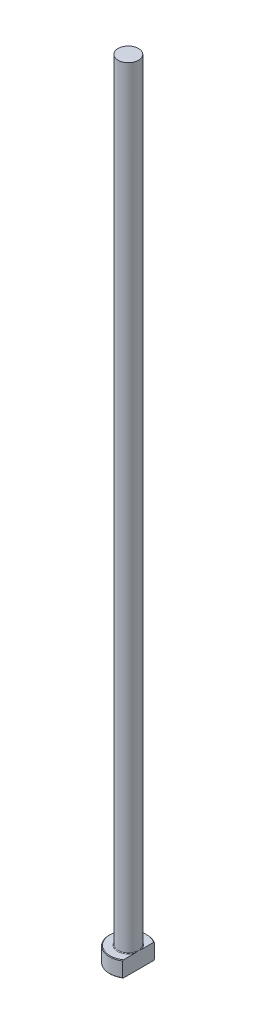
ISO-10303-21;
HEADER;
FILE_DESCRIPTION(('STEP AP214'),'2;1');
FILE_NAME('part.step','',(''),(''),'','','');
FILE_SCHEMA(('AUTOMOTIVE_DESIGN { 1 0 10303 214 1 1 1 1 }'));
ENDSEC;
DATA;
#1=APPLICATION_CONTEXT('core data for automotive mechanical design processes');
#2=APPLICATION_PROTOCOL_DEFINITION('international standard','automotive_design',2000,#1);
#3=PRODUCT_CONTEXT('',#1,'mechanical');
#4=PRODUCT('Part','Part','',(#3));
#5=PRODUCT_RELATED_PRODUCT_CATEGORY('part','',(#4));
#6=PRODUCT_DEFINITION_FORMATION('','',#4);
#7=PRODUCT_DEFINITION_CONTEXT('part definition',#1,'design');
#8=PRODUCT_DEFINITION('design','',#6,#7);
#9=PRODUCT_DEFINITION_SHAPE('','',#8);
#10=(LENGTH_UNIT() NAMED_UNIT(*) SI_UNIT(.MILLI.,.METRE.));
#11=(NAMED_UNIT(*) PLANE_ANGLE_UNIT() SI_UNIT($,.RADIAN.));
#12=(NAMED_UNIT(*) SI_UNIT($,.STERADIAN.) SOLID_ANGLE_UNIT());
#13=UNCERTAINTY_MEASURE_WITH_UNIT(LENGTH_MEASURE(1.E-05),#10,'distance_accuracy_value','');
#14=(GEOMETRIC_REPRESENTATION_CONTEXT(3) GLOBAL_UNCERTAINTY_ASSIGNED_CONTEXT((#13)) GLOBAL_UNIT_ASSIGNED_CONTEXT((#10,
#11,#12)) REPRESENTATION_CONTEXT('',''));
#15=CARTESIAN_POINT('',(0.,0.,0.));
#16=DIRECTION('',(0.,0.,1.));
#17=DIRECTION('',(1.,0.,0.));
#18=AXIS2_PLACEMENT_3D('',#15,#16,#17);
#19=CARTESIAN_POINT('',(0.,0.,0.));
#20=DIRECTION('',(0.,-1.,0.));
#21=DIRECTION('',(0.,0.,-1.));
#22=AXIS2_PLACEMENT_3D('',#19,#20,#21);
#23=PLANE('',#22);
#24=CARTESIAN_POINT('',(0.,0.,0.));
#25=DIRECTION('',(0.,-1.,0.));
#26=DIRECTION('',(0.,0.,-1.));
#27=AXIS2_PLACEMENT_3D('',#24,#25,#26);
#28=CIRCLE('',#27,5.79999999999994);
#29=CARTESIAN_POINT('',(3.24999999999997,0.,4.80390466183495));
#30=VERTEX_POINT('',#29);
#31=CARTESIAN_POINT('',(3.24999999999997,0.,-4.80390466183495));
#32=VERTEX_POINT('',#31);
#33=EDGE_CURVE('E98',#30,#32,#28,.T.);
#34=ORIENTED_EDGE('',*,*,#33,.T.);
#35=DIRECTION('',(0.,0.,1.));
#36=VECTOR('',#35,1.);
#37=CARTESIAN_POINT('',(3.24999999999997,0.,-5.04356025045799));
#38=LINE('',#37,#36);
#39=EDGE_CURVE('E83',#32,#30,#38,.T.);
#40=ORIENTED_EDGE('',*,*,#39,.T.);
#41=EDGE_LOOP('',(#34,#40));
#42=FACE_BOUND('',#41,.T.);
#43=ADVANCED_FACE('F32',(#42),#23,.T.);
#44=CARTESIAN_POINT('',(0.,259.958771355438,0.));
#45=DIRECTION('',(0.,1.,0.));
#46=DIRECTION('',(0.,0.,1.));
#47=AXIS2_PLACEMENT_3D('',#44,#45,#46);
#48=CYLINDRICAL_SURFACE('',#47,5.99999999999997);
#49=CARTESIAN_POINT('',(0.,4.80000000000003,0.));
#50=DIRECTION('',(0.,1.,0.));
#51=DIRECTION('',(0.,0.,1.));
#52=AXIS2_PLACEMENT_3D('',#49,#50,#51);
#53=CIRCLE('',#52,5.99999999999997);
#54=CARTESIAN_POINT('',(3.24999999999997,4.80000000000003,5.04356025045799));
#55=VERTEX_POINT('',#54);
#56=CARTESIAN_POINT('',(3.24999999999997,4.80000000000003,-5.04356025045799));
#57=VERTEX_POINT('',#56);
#58=EDGE_CURVE('E104',#55,#57,#53,.F.);
#59=ORIENTED_EDGE('',*,*,#58,.T.);
#60=DIRECTION('',(0.,-1.,0.));
#61=VECTOR('',#60,1.);
#62=CARTESIAN_POINT('',(3.24999999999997,250.,-5.04356025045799));
#63=LINE('',#62,#61);
#64=CARTESIAN_POINT('',(3.24999999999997,0.200000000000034,-5.04356025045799));
#65=VERTEX_POINT('',#64);
#66=EDGE_CURVE('E183',#57,#65,#63,.T.);
#67=ORIENTED_EDGE('',*,*,#66,.T.);
#68=CARTESIAN_POINT('',(0.,0.200000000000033,0.));
#69=DIRECTION('',(0.,-1.,0.));
#70=DIRECTION('',(0.,0.,-1.));
#71=AXIS2_PLACEMENT_3D('',#68,#69,#70);
#72=CIRCLE('',#71,5.99999999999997);
#73=CARTESIAN_POINT('',(3.24999999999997,0.200000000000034,5.04356025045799));
#74=VERTEX_POINT('',#73);
#75=EDGE_CURVE('E100',#65,#74,#72,.F.);
#76=ORIENTED_EDGE('',*,*,#75,.T.);
#77=DIRECTION('',(0.,-1.,0.));
#78=VECTOR('',#77,1.);
#79=CARTESIAN_POINT('',(3.24999999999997,250.,5.04356025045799));
#80=LINE('',#79,#78);
#81=EDGE_CURVE('E93',#55,#74,#80,.T.);
#82=ORIENTED_EDGE('',*,*,#81,.F.);
#83=EDGE_LOOP('',(#59,#67,#76,#82));
#84=FACE_BOUND('',#83,.T.);
#85=ADVANCED_FACE('F158',(#84),#48,.T.);
#86=CARTESIAN_POINT('',(-5.99999999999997,5.,0.));
#87=DIRECTION('',(0.,1.,0.));
#88=DIRECTION('',(0.,0.,1.));
#89=AXIS2_PLACEMENT_3D('',#86,#87,#88);
#90=PLANE('',#89);
#91=CARTESIAN_POINT('',(0.,5.,0.));
#92=DIRECTION('',(0.,1.,0.));
#93=DIRECTION('',(0.,0.,1.));
#94=AXIS2_PLACEMENT_3D('',#91,#92,#93);
#95=CIRCLE('',#94,5.79999999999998);
#96=CARTESIAN_POINT('',(3.24999999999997,5.,-4.80390466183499));
#97=VERTEX_POINT('',#96);
#98=CARTESIAN_POINT('',(3.24999999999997,5.,4.80390466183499));
#99=VERTEX_POINT('',#98);
#100=EDGE_CURVE('E178',#97,#99,#95,.T.);
#101=ORIENTED_EDGE('',*,*,#100,.T.);
#102=DIRECTION('',(0.,0.,-1.));
#103=VECTOR('',#102,1.);
#104=CARTESIAN_POINT('',(3.24999999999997,5.,0.));
#105=LINE('',#104,#103);
#106=CARTESIAN_POINT('',(3.24999999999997,4.99999999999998,1.15758369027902));
#107=VERTEX_POINT('',#106);
#108=EDGE_CURVE('E57',#99,#107,#105,.T.);
#109=ORIENTED_EDGE('',*,*,#108,.T.);
#110=CARTESIAN_POINT('',(0.,5.,0.));
#111=DIRECTION('',(0.,1.,0.));
#112=DIRECTION('',(0.,0.,1.));
#113=AXIS2_PLACEMENT_3D('',#110,#111,#112);
#114=CIRCLE('',#113,3.44999999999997);
#115=CARTESIAN_POINT('',(3.24999999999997,4.99999999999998,-1.15758369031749));
#116=VERTEX_POINT('',#115);
#117=EDGE_CURVE('E107',#107,#116,#114,.F.);
#118=ORIENTED_EDGE('',*,*,#117,.T.);
#119=EDGE_CURVE('E136',#116,#97,#105,.T.);
#120=ORIENTED_EDGE('',*,*,#119,.T.);
#121=EDGE_LOOP('',(#101,#109,#118,#120));
#122=FACE_BOUND('',#121,.T.);
#123=ADVANCED_FACE('F147',(#122),#90,.T.);
#124=CARTESIAN_POINT('',(0.,5.,0.));
#125=DIRECTION('',(0.,-1.,0.));
#126=DIRECTION('',(0.,0.,-1.));
#127=AXIS2_PLACEMENT_3D('',#124,#125,#126);
#128=CONICAL_SURFACE('',#127,5.79999999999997,0.785398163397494);
#129=ORIENTED_EDGE('',*,*,#58,.F.);
#130=CARTESIAN_POINT('',(3.24999999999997,-0.763340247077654,11.097222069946));
#131=CARTESIAN_POINT('',(3.24999999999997,-0.555249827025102,10.8803821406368));
#132=CARTESIAN_POINT('',(3.24999999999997,-0.347401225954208,10.6633095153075));
#133=CARTESIAN_POINT('',(3.24999999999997,0.0676973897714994,10.2285893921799));
#134=CARTESIAN_POINT('',(3.24999999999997,0.274947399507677,10.010941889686));
#135=CARTESIAN_POINT('',(3.24999999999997,0.68879015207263,9.5749031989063));
#136=CARTESIAN_POINT('',(3.24999999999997,0.895382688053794,9.35651181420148));
#137=CARTESIAN_POINT('',(3.24999999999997,1.30769007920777,8.91890298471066));
#138=CARTESIAN_POINT('',(3.24999999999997,1.51340493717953,8.69968554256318));
#139=CARTESIAN_POINT('',(3.24999999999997,1.92056067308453,8.26365159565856));
#140=CARTESIAN_POINT('',(3.24999999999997,2.1220182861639,8.04685072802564));
#141=CARTESIAN_POINT('',(3.24999999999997,2.52361432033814,7.61203089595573));
#142=CARTESIAN_POINT('',(3.24999999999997,2.72375274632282,7.39401193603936));
#143=CARTESIAN_POINT('',(3.24999999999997,3.1223203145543,6.95646589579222));
#144=CARTESIAN_POINT('',(3.24999999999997,3.32074966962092,6.73693900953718));
#145=CARTESIAN_POINT('',(3.24999999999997,3.71541049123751,6.2959206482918));
#146=CARTESIAN_POINT('',(3.24999999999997,3.91164199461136,6.07442920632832));
#147=CARTESIAN_POINT('',(3.24999999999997,4.26795525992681,5.66684646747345));
#148=CARTESIAN_POINT('',(3.24999999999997,4.42849662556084,5.48115751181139));
#149=CARTESIAN_POINT('',(3.24999999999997,4.74694681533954,5.10749706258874));
#150=CARTESIAN_POINT('',(3.24999999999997,4.9048553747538,4.91952534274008));
#151=CARTESIAN_POINT('',(3.24999999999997,5.21865243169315,4.53879767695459));
#152=CARTESIAN_POINT('',(3.24999999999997,5.37450606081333,4.34601291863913));
#153=CARTESIAN_POINT('',(3.24999999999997,5.68118935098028,3.95653844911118));
#154=CARTESIAN_POINT('',(3.24999999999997,5.83202036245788,3.75984981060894));
#155=CARTESIAN_POINT('',(3.24999999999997,6.05390638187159,3.4594085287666));
#156=CARTESIAN_POINT('',(3.24999999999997,6.12763821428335,3.35763377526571));
#157=CARTESIAN_POINT('',(3.24999999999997,6.27282302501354,3.15247478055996));
#158=CARTESIAN_POINT('',(3.24999999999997,6.3442761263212,3.04909062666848));
#159=CARTESIAN_POINT('',(3.24999999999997,6.48448981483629,2.84026816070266));
#160=CARTESIAN_POINT('',(3.24999999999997,6.55324599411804,2.7348268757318));
#161=CARTESIAN_POINT('',(3.24999999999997,6.68723865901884,2.52174014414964));
#162=CARTESIAN_POINT('',(3.24999999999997,6.75247550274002,2.4140949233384));
#163=CARTESIAN_POINT('',(3.24999999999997,6.87780644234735,2.19745654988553));
#164=CARTESIAN_POINT('',(3.24999999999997,6.93795082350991,2.08849289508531));
#165=CARTESIAN_POINT('',(3.24999999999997,7.05273719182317,1.86772106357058));
#166=CARTESIAN_POINT('',(3.24999999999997,7.10737807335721,1.75591232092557));
#167=CARTESIAN_POINT('',(3.24999999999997,7.26056715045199,1.41626442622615));
#168=CARTESIAN_POINT('',(3.24999999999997,7.34888232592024,1.1833811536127));
#169=CARTESIAN_POINT('',(3.24999999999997,7.44593218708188,0.835575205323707));
#170=CARTESIAN_POINT('',(3.24999999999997,7.4718222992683,0.725406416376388));
#171=CARTESIAN_POINT('',(3.24999999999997,7.51310579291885,0.5030789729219));
#172=CARTESIAN_POINT('',(3.24999999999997,7.52850034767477,0.390920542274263));
#173=CARTESIAN_POINT('',(3.24999999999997,7.54767882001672,0.166070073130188));
#174=CARTESIAN_POINT('',(3.24999999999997,7.5515109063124,0.0533822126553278));
#175=CARTESIAN_POINT('',(3.24999999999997,7.54741082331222,-0.171782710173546));
#176=CARTESIAN_POINT('',(3.24999999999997,7.5394779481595,-0.28425975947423));
#177=CARTESIAN_POINT('',(3.24999999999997,7.51253523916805,-0.507025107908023));
#178=CARTESIAN_POINT('',(3.24999999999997,7.4936058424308,-0.617323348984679));
#179=CARTESIAN_POINT('',(3.24999999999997,7.44595440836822,-0.835762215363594));
#180=CARTESIAN_POINT('',(3.24999999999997,7.41723093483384,-0.943902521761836));
#181=CARTESIAN_POINT('',(3.24999999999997,7.35127840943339,-1.15830231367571));
#182=CARTESIAN_POINT('',(3.24999999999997,7.31399439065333,-1.26454464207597));
#183=CARTESIAN_POINT('',(3.24999999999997,7.23254630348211,-1.47430332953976));
#184=CARTESIAN_POINT('',(3.24999999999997,7.18838353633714,-1.57782019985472));
#185=CARTESIAN_POINT('',(3.24999999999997,7.09672451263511,-1.7774238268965));
#186=CARTESIAN_POINT('',(3.24999999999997,7.04948595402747,-1.87363004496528));
#187=CARTESIAN_POINT('',(3.24999999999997,6.95089019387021,-2.06391775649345));
#188=CARTESIAN_POINT('',(3.24999999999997,6.89953216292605,-2.15799881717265));
#189=CARTESIAN_POINT('',(3.24999999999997,6.74036914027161,-2.43755985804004));
#190=CARTESIAN_POINT('',(3.24999999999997,6.62755752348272,-2.62018561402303));
#191=CARTESIAN_POINT('',(3.24999999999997,6.39256809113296,-2.98019331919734));
#192=CARTESIAN_POINT('',(3.24999999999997,6.27035601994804,-3.15755247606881));
#193=CARTESIAN_POINT('',(3.24999999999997,6.0197011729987,-3.50765833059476));
#194=CARTESIAN_POINT('',(3.24999999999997,5.8912614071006,-3.68040719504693));
#195=CARTESIAN_POINT('',(3.24999999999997,5.62829316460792,-4.02448614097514));
#196=CARTESIAN_POINT('',(3.24999999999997,5.49371006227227,-4.19577421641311));
#197=CARTESIAN_POINT('',(3.24999999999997,5.22110967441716,-4.5356145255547));
#198=CARTESIAN_POINT('',(3.24999999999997,5.08309204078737,-4.70416647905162));
#199=CARTESIAN_POINT('',(3.24999999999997,4.80478673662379,-5.03871726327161));
#200=CARTESIAN_POINT('',(3.24999999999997,4.66450509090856,-5.20472111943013));
#201=CARTESIAN_POINT('',(3.24999999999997,4.38193422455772,-5.53501285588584));
#202=CARTESIAN_POINT('',(3.24999999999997,4.23964496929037,-5.69930070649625));
#203=CARTESIAN_POINT('',(3.24999999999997,3.89726045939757,-6.09077577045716));
#204=CARTESIAN_POINT('',(3.24999999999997,3.69642117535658,-6.31731165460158));
#205=CARTESIAN_POINT('',(3.24999999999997,3.29246897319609,-6.76834962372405));
#206=CARTESIAN_POINT('',(3.24999999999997,3.08935601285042,-6.99285167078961));
#207=CARTESIAN_POINT('',(3.24999999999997,2.68122553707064,-7.44046009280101));
#208=CARTESIAN_POINT('',(3.24999999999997,2.47620657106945,-7.66356514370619));
#209=CARTESIAN_POINT('',(3.24999999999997,2.06481442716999,-8.10852300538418));
#210=CARTESIAN_POINT('',(3.24999999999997,1.85844124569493,-8.33037581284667));
#211=CARTESIAN_POINT('',(3.24999999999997,1.45176082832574,-8.76543407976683));
#212=CARTESIAN_POINT('',(3.24999999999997,1.25149010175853,-8.9786736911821));
#213=CARTESIAN_POINT('',(3.24999999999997,0.850131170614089,-9.40438299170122));
#214=CARTESIAN_POINT('',(3.24999999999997,0.649042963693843,-9.61685267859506));
#215=CARTESIAN_POINT('',(3.24999999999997,0.246391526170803,-10.0409455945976));
#216=CARTESIAN_POINT('',(3.24999999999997,0.0448289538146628,-10.2525694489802));
#217=CARTESIAN_POINT('',(3.24999999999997,-0.358859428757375,-10.6752763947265));
#218=CARTESIAN_POINT('',(3.24999999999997,-0.560985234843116,-10.8863594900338));
#219=CARTESIAN_POINT('',(3.24999999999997,-0.763340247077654,-11.097222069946));
#220=B_SPLINE_CURVE_WITH_KNOTS('',3,(#130,#131,#132,#133,#134,#135,#136,#137,#138,#139,#140,
#141,#142,#143,#144,#145,#146,#147,#148,#149,#150,#151,#152,#153,#154,#155,#156,#157,#158,#159,
#160,#161,#162,#163,#164,#165,#166,#167,#168,#169,#170,#171,#172,#173,#174,#175,#176,#177,#178,
#179,#180,#181,#182,#183,#184,#185,#186,#187,#188,#189,#190,#191,#192,#193,#194,#195,#196,#197,
#198,#199,#200,#201,#202,#203,#204,#205,#206,#207,#208,#209,#210,#211,#212,#213,#214,#215,#216,
#217,#218,#219),.UNSPECIFIED.,.F.,.F.,(4,2,2,2,2,2,2,2,2,2,2,2,2,2,2,2,2,2,2,2,2,2,2,2,2,2,2,2,
2,2,2,2,2,2,2,2,2,2,2,2,2,2,2,2,4),(0.,0.901604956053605,1.80321729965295,2.70508973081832,
3.60695928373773,4.49481204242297,5.3826615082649,6.27039876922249,7.15812113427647,
7.89450333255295,8.63095913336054,9.37461869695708,10.1180766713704,10.4950808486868,
10.8720646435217,11.2496408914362,11.6271786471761,12.0003984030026,12.3736929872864,
13.117405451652,13.4565058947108,13.795568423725,14.1332164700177,14.4708847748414,
14.8061136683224,15.1413917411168,15.4788860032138,15.8163164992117,16.1377318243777,
16.4592120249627,17.1027431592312,17.7487418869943,18.3944314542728,19.0478814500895,
19.7013979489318,20.3533948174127,21.0054029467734,21.9136176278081,22.8218492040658,
23.7308402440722,24.6398336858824,25.5174503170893,26.3950694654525,27.2718289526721,
28.1485820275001),.UNSPECIFIED.);
#221=EDGE_CURVE('E135',#55,#99,#220,.T.);
#222=ORIENTED_EDGE('',*,*,#221,.T.);
#223=ORIENTED_EDGE('',*,*,#100,.F.);
#224=EDGE_CURVE('E127',#97,#57,#220,.T.);
#225=ORIENTED_EDGE('',*,*,#224,.T.);
#226=EDGE_LOOP('',(#129,#222,#223,#225));
#227=FACE_BOUND('',#226,.T.);
#228=ADVANCED_FACE('F143',(#227),#128,.T.);
#229=CARTESIAN_POINT('',(0.,0.200000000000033,0.));
#230=DIRECTION('',(0.,1.,0.));
#231=DIRECTION('',(0.,0.,1.));
#232=AXIS2_PLACEMENT_3D('',#229,#230,#231);
#233=CONICAL_SURFACE('',#232,5.99999999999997,0.785398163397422);
#234=ORIENTED_EDGE('',*,*,#75,.F.);
#235=CARTESIAN_POINT('',(3.24999999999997,5.76334024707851,-11.0972220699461));
#236=CARTESIAN_POINT('',(3.24999999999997,5.55524982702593,-10.8803821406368));
#237=CARTESIAN_POINT('',(3.24999999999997,5.347401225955,-10.6633095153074));
#238=CARTESIAN_POINT('',(3.24999999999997,4.93230261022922,-10.2285893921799));
#239=CARTESIAN_POINT('',(3.24999999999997,4.72505260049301,-10.0109418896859));
#240=CARTESIAN_POINT('',(3.24999999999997,4.31120984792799,-9.57490319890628));
#241=CARTESIAN_POINT('',(3.24999999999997,4.10461731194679,-9.35651181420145));
#242=CARTESIAN_POINT('',(3.24999999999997,3.69230992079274,-8.91890298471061));
#243=CARTESIAN_POINT('',(3.24999999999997,3.48659506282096,-8.69968554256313));
#244=CARTESIAN_POINT('',(3.24999999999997,3.07943932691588,-8.26365159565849));
#245=CARTESIAN_POINT('',(3.24999999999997,2.87798171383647,-8.04685072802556));
#246=CARTESIAN_POINT('',(3.24999999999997,2.47638567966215,-7.61203089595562));
#247=CARTESIAN_POINT('',(3.24999999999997,2.27624725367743,-7.39401193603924));
#248=CARTESIAN_POINT('',(3.24999999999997,1.87767968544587,-6.95646589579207));
#249=CARTESIAN_POINT('',(3.24999999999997,1.6792503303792,-6.73693900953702));
#250=CARTESIAN_POINT('',(3.24999999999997,1.28458950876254,-6.29592064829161));
#251=CARTESIAN_POINT('',(3.24999999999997,1.08835800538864,-6.07442920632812));
#252=CARTESIAN_POINT('',(3.24999999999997,0.732044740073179,-5.66684646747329));
#253=CARTESIAN_POINT('',(3.24999999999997,0.57150337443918,-5.48115751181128));
#254=CARTESIAN_POINT('',(3.24999999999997,0.253053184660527,-5.10749706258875));
#255=CARTESIAN_POINT('',(3.24999999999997,0.0951446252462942,-4.91952534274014));
#256=CARTESIAN_POINT('',(3.24999999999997,-0.218652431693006,-4.53879767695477));
#257=CARTESIAN_POINT('',(3.24999999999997,-0.374506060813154,-4.34601291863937));
#258=CARTESIAN_POINT('',(3.24999999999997,-0.681189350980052,-3.95653844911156));
#259=CARTESIAN_POINT('',(3.24999999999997,-0.832020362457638,-3.75984981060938));
#260=CARTESIAN_POINT('',(3.24999999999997,-1.05390638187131,-3.45940852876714));
#261=CARTESIAN_POINT('',(3.24999999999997,-1.12763821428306,-3.35763377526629));
#262=CARTESIAN_POINT('',(3.24999999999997,-1.27282302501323,-3.15247478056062));
#263=CARTESIAN_POINT('',(3.24999999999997,-1.34427612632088,-3.04909062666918));
#264=CARTESIAN_POINT('',(3.24999999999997,-1.48448981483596,-2.84026816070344));
#265=CARTESIAN_POINT('',(3.24999999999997,-1.5532459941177,-2.73482687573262));
#266=CARTESIAN_POINT('',(3.24999999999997,-1.6872386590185,-2.52174014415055));
#267=CARTESIAN_POINT('',(3.24999999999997,-1.75247550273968,-2.41409492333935));
#268=CARTESIAN_POINT('',(3.24999999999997,-1.87780644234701,-2.19745654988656));
#269=CARTESIAN_POINT('',(3.24999999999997,-1.93795082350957,-2.08849289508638));
#270=CARTESIAN_POINT('',(3.24999999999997,-2.05273719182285,-1.86772106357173));
#271=CARTESIAN_POINT('',(3.24999999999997,-2.10737807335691,-1.75591232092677));
#272=CARTESIAN_POINT('',(3.24999999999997,-2.26056715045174,-1.41626442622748));
#273=CARTESIAN_POINT('',(3.24999999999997,-2.34888232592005,-1.18338115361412));
#274=CARTESIAN_POINT('',(3.24999999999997,-2.44593218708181,-0.835575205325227));
#275=CARTESIAN_POINT('',(3.24999999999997,-2.47182229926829,-0.725406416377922));
#276=CARTESIAN_POINT('',(3.24999999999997,-2.51310579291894,-0.50307897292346));
#277=CARTESIAN_POINT('',(3.24999999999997,-2.52850034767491,-0.390920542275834));
#278=CARTESIAN_POINT('',(3.24999999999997,-2.54767882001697,-0.166070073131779));
#279=CARTESIAN_POINT('',(3.24999999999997,-2.5515109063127,-0.0533822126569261));
#280=CARTESIAN_POINT('',(3.24999999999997,-2.54741082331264,0.171782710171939));
#281=CARTESIAN_POINT('',(3.24999999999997,-2.53947794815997,0.284259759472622));
#282=CARTESIAN_POINT('',(3.24999999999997,-2.51253523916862,0.507025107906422));
#283=CARTESIAN_POINT('',(3.24999999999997,-2.49360584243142,0.617323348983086));
#284=CARTESIAN_POINT('',(3.24999999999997,-2.44595440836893,0.835762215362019));
#285=CARTESIAN_POINT('',(3.24999999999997,-2.41723093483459,0.943902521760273));
#286=CARTESIAN_POINT('',(3.24999999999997,-2.35127840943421,1.15830231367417));
#287=CARTESIAN_POINT('',(3.24999999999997,-2.31399439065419,1.26454464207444));
#288=CARTESIAN_POINT('',(3.24999999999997,-2.23254630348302,1.47430332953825));
#289=CARTESIAN_POINT('',(3.24999999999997,-2.18838353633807,1.57782019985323));
#290=CARTESIAN_POINT('',(3.24999999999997,-2.09672451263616,1.77742382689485));
#291=CARTESIAN_POINT('',(3.24999999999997,-2.04948595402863,1.87363004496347));
#292=CARTESIAN_POINT('',(3.24999999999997,-1.95089019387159,2.06391775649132));
#293=CARTESIAN_POINT('',(3.24999999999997,-1.89953216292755,2.15799881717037));
#294=CARTESIAN_POINT('',(3.24999999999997,-1.74036914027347,2.4375598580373));
#295=CARTESIAN_POINT('',(3.24999999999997,-1.62755752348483,2.62018561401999));
#296=CARTESIAN_POINT('',(3.24999999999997,-1.39256809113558,2.98019331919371));
#297=CARTESIAN_POINT('',(3.24999999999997,-1.27035601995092,3.15755247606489));
#298=CARTESIAN_POINT('',(3.24999999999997,-1.01970117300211,3.50765833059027));
#299=CARTESIAN_POINT('',(3.24999999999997,-0.891261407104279,3.68040719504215));
#300=CARTESIAN_POINT('',(3.24999999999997,-0.628293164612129,4.0244861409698));
#301=CARTESIAN_POINT('',(3.24999999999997,-0.493710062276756,4.19577421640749));
#302=CARTESIAN_POINT('',(3.24999999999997,-0.221109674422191,4.53561452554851));
#303=CARTESIAN_POINT('',(3.24999999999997,-0.0830920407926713,4.70416647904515));
#304=CARTESIAN_POINT('',(3.24999999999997,0.19521326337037,5.03871726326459));
#305=CARTESIAN_POINT('',(3.24999999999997,0.335494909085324,5.20472111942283));
#306=CARTESIAN_POINT('',(3.24999999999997,0.618065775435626,5.53501285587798));
#307=CARTESIAN_POINT('',(3.24999999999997,0.7603550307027,5.69930070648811));
#308=CARTESIAN_POINT('',(3.24999999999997,1.10273954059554,6.09077577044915));
#309=CARTESIAN_POINT('',(3.24999999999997,1.30357882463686,6.31731165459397));
#310=CARTESIAN_POINT('',(3.24999999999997,1.70753102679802,6.76834962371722));
#311=CARTESIAN_POINT('',(3.24999999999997,1.91064398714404,6.99285167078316));
#312=CARTESIAN_POINT('',(3.24999999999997,2.31877446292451,7.44046009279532));
#313=CARTESIAN_POINT('',(3.24999999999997,2.52379342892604,7.66356514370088));
#314=CARTESIAN_POINT('',(3.24999999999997,2.93518557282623,8.10852300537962));
#315=CARTESIAN_POINT('',(3.24999999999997,3.14155875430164,8.33037581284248));
#316=CARTESIAN_POINT('',(3.24999999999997,3.54823917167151,8.76543407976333));
#317=CARTESIAN_POINT('',(3.24999999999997,3.74850989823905,8.97867369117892));
#318=CARTESIAN_POINT('',(3.24999999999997,4.14986882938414,9.40438299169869));
#319=CARTESIAN_POINT('',(3.24999999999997,4.35095703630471,9.61685267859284));
#320=CARTESIAN_POINT('',(3.24999999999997,4.75360847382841,10.040945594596));
#321=CARTESIAN_POINT('',(3.24999999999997,4.95517104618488,10.252569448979));
#322=CARTESIAN_POINT('',(3.24999999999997,5.35885942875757,10.6752763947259));
#323=CARTESIAN_POINT('',(3.24999999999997,5.56098523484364,10.8863594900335));
#324=CARTESIAN_POINT('',(3.24999999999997,5.76334024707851,11.097222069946));
#325=B_SPLINE_CURVE_WITH_KNOTS('',3,(#235,#236,#237,#238,#239,#240,#241,#242,#243,#244,#245,
#246,#247,#248,#249,#250,#251,#252,#253,#254,#255,#256,#257,#258,#259,#260,#261,#262,#263,#264,
#265,#266,#267,#268,#269,#270,#271,#272,#273,#274,#275,#276,#277,#278,#279,#280,#281,#282,#283,
#284,#285,#286,#287,#288,#289,#290,#291,#292,#293,#294,#295,#296,#297,#298,#299,#300,#301,#302,
#303,#304,#305,#306,#307,#308,#309,#310,#311,#312,#313,#314,#315,#316,#317,#318,#319,#320,#321,
#322,#323,#324),.UNSPECIFIED.,.F.,.F.,(4,2,2,2,2,2,2,2,2,2,2,2,2,2,2,2,2,2,2,2,2,2,2,2,2,2,2,2,
2,2,2,2,2,2,2,2,2,2,2,2,2,2,2,2,4),(0.,0.901604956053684,1.80321729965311,2.70508973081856,
3.60695928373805,4.4948120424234,5.38266150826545,6.27039876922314,7.15812113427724,
7.89450333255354,8.63095913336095,9.3746186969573,10.1180766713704,10.4950808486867,
10.8720646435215,11.2496408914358,11.6271786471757,12.000398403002,12.3736929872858,
13.1174054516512,13.4565058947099,13.7955684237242,14.1332164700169,14.4708847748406,
14.8061136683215,15.1413917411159,15.478886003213,15.8163164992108,16.1377318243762,
16.4592120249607,17.1027431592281,17.74874188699,18.3944314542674,19.0478814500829,
19.701397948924,20.3533948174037,21.0054029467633,21.9136176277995,22.8218492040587,
23.7308402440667,24.6398336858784,25.5174503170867,26.3950694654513,27.2718289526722,
28.1485820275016),.UNSPECIFIED.);
#326=EDGE_CURVE('E86',#65,#32,#325,.T.);
#327=ORIENTED_EDGE('',*,*,#326,.T.);
#328=ORIENTED_EDGE('',*,*,#33,.F.);
#329=EDGE_CURVE('E89',#30,#74,#325,.T.);
#330=ORIENTED_EDGE('',*,*,#329,.T.);
#331=EDGE_LOOP('',(#234,#327,#328,#330));
#332=FACE_BOUND('',#331,.T.);
#333=ADVANCED_FACE('F97',(#332),#233,.T.);
#334=CARTESIAN_POINT('',(0.,5.19999999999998,0.));
#335=DIRECTION('',(0.,1.,0.));
#336=DIRECTION('',(0.,0.,1.));
#337=AXIS2_PLACEMENT_3D('',#334,#335,#336);
#338=TOROIDAL_SURFACE('',#337,3.44999999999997,0.2);
#339=CARTESIAN_POINT('',(3.24999999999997,5.19999999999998,0.));
#340=CARTESIAN_POINT('',(3.24999999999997,5.20000050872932,1.30593484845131E-10));
#341=CARTESIAN_POINT('',(3.24999999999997,5.20000101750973,-2.02989018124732E-07));
#342=CARTESIAN_POINT('',(3.24999999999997,5.20000196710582,-7.62846146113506E-07));
#343=CARTESIAN_POINT('',(3.24999999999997,5.20000239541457,-1.13332165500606E-06));
#344=CARTESIAN_POINT('',(3.24999999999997,5.20000328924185,-2.02149564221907E-06));
#345=CARTESIAN_POINT('',(3.24999999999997,5.20000374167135,-2.55359112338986E-06));
#346=CARTESIAN_POINT('',(3.24999999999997,5.20000454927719,-3.65434903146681E-06));
#347=CARTESIAN_POINT('',(3.24999999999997,5.20000490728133,-4.22110424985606E-06));
#348=CARTESIAN_POINT('',(3.24999999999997,5.20000624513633,-6.42540895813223E-06));
#349=CARTESIAN_POINT('',(3.24999999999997,5.20000715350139,-8.1091236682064E-06));
#350=CARTESIAN_POINT('',(3.24999999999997,5.20000863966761,-1.14364149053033E-05));
#351=CARTESIAN_POINT('',(3.24999999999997,5.20000923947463,-1.30705587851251E-05));
#352=CARTESIAN_POINT('',(3.24999999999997,5.20001177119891,-2.00139280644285E-05));
#353=CARTESIAN_POINT('',(3.24999999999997,5.20001367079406,-2.53379428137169E-05));
#354=CARTESIAN_POINT('',(3.24999999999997,5.20001645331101,-3.53765138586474E-05));
#355=CARTESIAN_POINT('',(3.24999999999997,5.20001744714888,-4.00600779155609E-05));
#356=CARTESIAN_POINT('',(3.24999999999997,5.20002471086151,-7.49504389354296E-05));
#357=CARTESIAN_POINT('',(3.24999999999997,5.20003024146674,-0.00010526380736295));
#358=CARTESIAN_POINT('',(3.24999999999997,5.20005445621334,-0.00022532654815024));
#359=CARTESIAN_POINT('',(3.24999999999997,5.20007753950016,-0.000314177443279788));
#360=CARTESIAN_POINT('',(3.24999999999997,5.20016768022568,-0.000666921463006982));
#361=CARTESIAN_POINT('',(3.24999999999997,5.20023191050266,-0.000931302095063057));
#362=CARTESIAN_POINT('',(3.24999999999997,5.20048969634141,-0.00198463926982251));
#363=CARTESIAN_POINT('',(3.24999999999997,5.20068683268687,-0.0027729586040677));
#364=CARTESIAN_POINT('',(3.24999999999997,5.20150726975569,-0.00606245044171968));
#365=CARTESIAN_POINT('',(3.24999999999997,5.20212605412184,-0.00856442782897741));
#366=CARTESIAN_POINT('',(3.24999999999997,5.20719838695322,-0.0290628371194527));
#367=CARTESIAN_POINT('',(3.24999999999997,5.21166800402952,-0.0470565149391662));
#368=CARTESIAN_POINT('',(3.24999999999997,5.22040162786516,-0.0823313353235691));
#369=CARTESIAN_POINT('',(3.24999999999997,5.22466671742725,-0.0996122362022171));
#370=CARTESIAN_POINT('',(3.24999999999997,5.23855308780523,-0.156076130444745));
#371=CARTESIAN_POINT('',(3.24999999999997,5.24811538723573,-0.195273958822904));
#372=CARTESIAN_POINT('',(3.24999999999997,5.26421029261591,-0.262424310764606));
#373=CARTESIAN_POINT('',(3.24999999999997,5.27082096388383,-0.290358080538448));
#374=CARTESIAN_POINT('',(3.24999999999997,5.28365202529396,-0.345539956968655));
#375=CARTESIAN_POINT('',(3.24999999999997,5.28987810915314,-0.3727867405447));
#376=CARTESIAN_POINT('',(3.24999999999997,5.30721519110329,-0.45039737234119));
#377=CARTESIAN_POINT('',(3.24999999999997,5.31800675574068,-0.500833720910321));
#378=CARTESIAN_POINT('',(3.24999999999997,5.33836987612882,-0.60242326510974));
#379=CARTESIAN_POINT('',(3.24999999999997,5.34792968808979,-0.653578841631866));
#380=CARTESIAN_POINT('',(3.24999999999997,5.36597954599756,-0.760718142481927));
#381=CARTESIAN_POINT('',(3.24999999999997,5.37430170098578,-0.81673101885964));
#382=CARTESIAN_POINT('',(3.24999999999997,5.38793579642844,-0.928977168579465));
#383=CARTESIAN_POINT('',(3.24999999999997,5.39325594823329,-0.985209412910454));
#384=CARTESIAN_POINT('',(3.24999999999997,5.39967715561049,-1.09627192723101));
#385=CARTESIAN_POINT('',(3.24999999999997,5.40090002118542,-1.15109363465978));
#386=CARTESIAN_POINT('',(3.24999999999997,5.39854105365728,-1.23278196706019));
#387=CARTESIAN_POINT('',(3.24999999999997,5.397083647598,-1.25970835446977));
#388=CARTESIAN_POINT('',(3.24999999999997,5.39248016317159,-1.31340846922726));
#389=CARTESIAN_POINT('',(3.24999999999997,5.38933527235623,-1.34018229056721));
#390=CARTESIAN_POINT('',(3.24999999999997,5.38085808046,-1.39365539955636));
#391=CARTESIAN_POINT('',(3.24999999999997,5.37550486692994,-1.42035144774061));
#392=CARTESIAN_POINT('',(3.24999999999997,5.36186683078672,-1.47304562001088));
#393=CARTESIAN_POINT('',(3.24999999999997,5.35358306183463,-1.49904399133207));
#394=CARTESIAN_POINT('',(3.24999999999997,5.33840624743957,-1.53566403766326));
#395=CARTESIAN_POINT('',(3.24999999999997,5.33319528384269,-1.54697847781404));
#396=CARTESIAN_POINT('',(3.24999999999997,5.32165705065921,-1.56904809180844));
#397=CARTESIAN_POINT('',(3.24999999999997,5.31532920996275,-1.57980297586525));
#398=CARTESIAN_POINT('',(3.24999999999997,5.30232638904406,-1.5988624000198));
#399=CARTESIAN_POINT('',(3.24999999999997,5.2958406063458,-1.60729427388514));
#400=CARTESIAN_POINT('',(3.24999999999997,5.28165581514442,-1.62307272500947));
#401=CARTESIAN_POINT('',(3.24999999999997,5.2739607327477,-1.63042267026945));
#402=CARTESIAN_POINT('',(3.24999999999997,5.26066720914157,-1.64067803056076));
#403=CARTESIAN_POINT('',(3.24999999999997,5.25551950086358,-1.64416379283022));
#404=CARTESIAN_POINT('',(3.24999999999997,5.24475577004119,-1.65032852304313));
#405=CARTESIAN_POINT('',(3.24999999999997,5.23914006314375,-1.65300802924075));
#406=CARTESIAN_POINT('',(3.24999999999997,5.22744494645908,-1.65736207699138));
#407=CARTESIAN_POINT('',(3.24999999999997,5.22136079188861,-1.65902420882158));
#408=CARTESIAN_POINT('',(3.24999999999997,5.20898349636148,-1.66109219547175));
#409=CARTESIAN_POINT('',(3.24999999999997,5.20269065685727,-1.66149978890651));
#410=CARTESIAN_POINT('',(3.24999999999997,5.19107570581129,-1.66104520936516));
#411=CARTESIAN_POINT('',(3.24999999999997,5.18574582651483,-1.66035949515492));
#412=CARTESIAN_POINT('',(3.24999999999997,5.17527668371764,-1.65810570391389));
#413=CARTESIAN_POINT('',(3.24999999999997,5.1701375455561,-1.65653705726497));
#414=CARTESIAN_POINT('',(3.24999999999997,5.15872192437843,-1.65208432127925));
#415=CARTESIAN_POINT('',(3.24999999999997,5.15254320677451,-1.64895170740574));
#416=CARTESIAN_POINT('',(3.24999999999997,5.14076776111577,-1.64173915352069));
#417=CARTESIAN_POINT('',(3.24999999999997,5.13517231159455,-1.63765719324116));
#418=CARTESIAN_POINT('',(3.24999999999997,5.12145239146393,-1.62621801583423));
#419=CARTESIAN_POINT('',(3.24999999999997,5.11376432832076,-1.61834208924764));
#420=CARTESIAN_POINT('',(3.24999999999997,5.09963913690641,-1.6015591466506));
#421=CARTESIAN_POINT('',(3.24999999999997,5.0932043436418,-1.59265025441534));
#422=CARTESIAN_POINT('',(3.24999999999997,5.07579513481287,-1.56554611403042));
#423=CARTESIAN_POINT('',(3.24999999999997,5.06621235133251,-1.54646705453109));
#424=CARTESIAN_POINT('',(3.24999999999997,5.04964498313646,-1.5071324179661));
#425=CARTESIAN_POINT('',(3.24999999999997,5.04268052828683,-1.48686905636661));
#426=CARTESIAN_POINT('',(3.24999999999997,5.02812767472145,-1.43684519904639));
#427=CARTESIAN_POINT('',(3.24999999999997,5.02158372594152,-1.40678481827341));
#428=CARTESIAN_POINT('',(3.24999999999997,5.01134780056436,-1.3461374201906));
#429=CARTESIAN_POINT('',(3.24999999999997,5.00766434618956,-1.31554910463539));
#430=CARTESIAN_POINT('',(3.24999999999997,5.00256038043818,-1.2550900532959));
#431=CARTESIAN_POINT('',(3.24999999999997,5.00107707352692,-1.22522437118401));
#432=CARTESIAN_POINT('',(3.24999999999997,4.99975288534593,-1.16560651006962));
#433=CARTESIAN_POINT('',(3.24999999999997,4.99990422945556,-1.13585446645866));
#434=CARTESIAN_POINT('',(3.24999999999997,5.00180470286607,-1.06636643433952));
#435=CARTESIAN_POINT('',(3.24999999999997,5.00407520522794,-1.02664548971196));
#436=CARTESIAN_POINT('',(3.24999999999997,5.01046283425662,-0.947373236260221));
#437=CARTESIAN_POINT('',(3.24999999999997,5.01457941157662,-0.907821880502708));
#438=CARTESIAN_POINT('',(3.24999999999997,5.02439538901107,-0.827971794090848));
#439=CARTESIAN_POINT('',(3.24999999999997,5.03012984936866,-0.787677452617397));
#440=CARTESIAN_POINT('',(3.24999999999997,5.0428354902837,-0.707180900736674));
#441=CARTESIAN_POINT('',(3.24999999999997,5.04980982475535,-0.666979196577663));
#442=CARTESIAN_POINT('',(3.24999999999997,5.06745383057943,-0.572058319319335));
#443=CARTESIAN_POINT('',(3.24999999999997,5.07854113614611,-0.517417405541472));
#444=CARTESIAN_POINT('',(3.24999999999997,5.10182947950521,-0.409021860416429));
#445=CARTESIAN_POINT('',(3.24999999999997,5.11401657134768,-0.355264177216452));
#446=CARTESIAN_POINT('',(3.24999999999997,5.13769793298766,-0.254099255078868));
#447=CARTESIAN_POINT('',(3.24999999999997,5.14911069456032,-0.206672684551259));
#448=CARTESIAN_POINT('',(3.24999999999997,5.1727713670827,-0.109852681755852));
#449=CARTESIAN_POINT('',(3.24999999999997,5.18503405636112,-0.0604628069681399));
#450=CARTESIAN_POINT('',(3.24999999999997,5.19787537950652,-0.0085581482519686));
#451=CARTESIAN_POINT('',(3.24999999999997,5.19849580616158,-0.00604992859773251));
#452=CARTESIAN_POINT('',(3.24999999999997,5.19931662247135,-0.00275902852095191));
#453=CARTESIAN_POINT('',(3.24999999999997,5.19951254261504,-0.00197555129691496));
#454=CARTESIAN_POINT('',(3.24999999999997,5.1997688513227,-0.000928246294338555));
#455=CARTESIAN_POINT('',(3.24999999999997,5.19983279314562,-0.000665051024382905));
#456=CARTESIAN_POINT('',(3.24999999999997,5.19992258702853,-0.000313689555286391));
#457=CARTESIAN_POINT('',(3.24999999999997,5.19994562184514,-0.000225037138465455));
#458=CARTESIAN_POINT('',(3.24999999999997,5.19996979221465,-0.000105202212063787));
#459=CARTESIAN_POINT('',(3.24999999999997,5.19997531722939,-7.49162835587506E-05));
#460=CARTESIAN_POINT('',(3.24999999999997,5.19998256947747,-4.0053976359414E-05));
#461=CARTESIAN_POINT('',(3.24999999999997,5.1999835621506,-3.53718998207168E-05));
#462=CARTESIAN_POINT('',(3.24999999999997,5.19998634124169,-2.53364128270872E-05));
#463=CARTESIAN_POINT('',(3.24999999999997,5.19998823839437,-2.00139156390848E-05));
#464=CARTESIAN_POINT('',(3.24999999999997,5.19999076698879,-1.30721306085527E-05));
#465=CARTESIAN_POINT('',(3.24999999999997,5.19999136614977,-1.14380977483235E-05));
#466=CARTESIAN_POINT('',(3.24999999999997,5.19999285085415,-8.11092555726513E-06));
#467=CARTESIAN_POINT('',(3.24999999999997,5.19999375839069,-6.42720440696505E-06));
#468=CARTESIAN_POINT('',(3.24999999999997,5.19999509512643,-4.2227718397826E-06));
#469=CARTESIAN_POINT('',(3.24999999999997,5.1999954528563,-3.65594799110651E-06));
#470=CARTESIAN_POINT('',(3.24999999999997,5.19999625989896,-2.55500330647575E-06));
#471=CARTESIAN_POINT('',(3.24999999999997,5.19999671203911,-2.0227876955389E-06));
#472=CARTESIAN_POINT('',(3.24999999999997,5.19999760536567,-1.13433308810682E-06));
#473=CARTESIAN_POINT('',(3.24999999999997,5.19999803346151,-7.63708107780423E-07));
#474=CARTESIAN_POINT('',(3.24999999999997,5.19999898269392,-2.03470796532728E-07));
#475=CARTESIAN_POINT('',(3.24999999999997,5.19999949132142,-1.30580450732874E-10));
#476=CARTESIAN_POINT('',(3.24999999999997,5.19999999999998,0.));
#477=B_SPLINE_CURVE_WITH_KNOTS('',3,(#339,#340,#341,#342,#343,#344,#345,#346,#347,#348,#349,
#350,#351,#352,#353,#354,#355,#356,#357,#358,#359,#360,#361,#362,#363,#364,#365,#366,#367,#368,
#369,#370,#371,#372,#373,#374,#375,#376,#377,#378,#379,#380,#381,#382,#383,#384,#385,#386,#387,
#388,#389,#390,#391,#392,#393,#394,#395,#396,#397,#398,#399,#400,#401,#402,#403,#404,#405,#406,
#407,#408,#409,#410,#411,#412,#413,#414,#415,#416,#417,#418,#419,#420,#421,#422,#423,#424,#425,
#426,#427,#428,#429,#430,#431,#432,#433,#434,#435,#436,#437,#438,#439,#440,#441,#442,#443,#444,
#445,#446,#447,#448,#449,#450,#451,#452,#453,#454,#455,#456,#457,#458,#459,#460,#461,#462,#463,
#464,#465,#466,#467,#468,#469,#470,#471,#472,#473,#474,#475,#476),.UNSPECIFIED.,.T.,.F.,(4,2,2,
2,2,2,2,2,2,2,2,2,2,2,2,2,2,2,2,2,2,2,2,2,2,2,2,2,2,2,2,2,2,2,2,2,2,2,2,2,2,2,2,2,2,2,2,2,2,2,2,
2,2,2,2,2,2,2,2,2,2,2,2,2,2,2,2,2,4),(0.,1.54201220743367E-06,3.24382184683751E-06,
5.32610111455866E-06,7.33619204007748E-06,1.30552971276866E-05,1.82727733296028E-05,
3.52029744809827E-05,4.95493511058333E-05,0.000142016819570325,0.000417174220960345,
0.00123364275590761,0.00367111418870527,0.0114035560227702,0.0670234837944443,0.120422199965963,
0.241463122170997,0.327578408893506,0.411425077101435,0.566146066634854,0.722247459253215,
0.892069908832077,1.06142556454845,1.22569945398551,1.30655828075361,1.38736027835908,
1.46894569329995,1.55050180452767,1.58782892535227,1.62517518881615,1.65700740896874,
1.68873834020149,1.70733388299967,1.72591698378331,1.74472246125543,1.76350186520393,
1.77954337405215,1.79559524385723,1.81626176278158,1.83697267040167,1.86980451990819,
1.90269696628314,1.96639085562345,2.03056487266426,2.12263115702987,2.21497069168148,
2.30462030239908,2.39384371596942,2.51314182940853,2.632404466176,2.75448156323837,
2.8768737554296,3.04411391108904,3.20947099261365,3.35581134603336,3.50847473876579,
3.51622652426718,3.51864902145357,3.5194618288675,3.51973637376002,3.51982875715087,
3.51984309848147,3.51986002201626,3.51986523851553,3.5198709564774,3.51987296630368,
3.51987504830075,3.51987674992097,3.51987829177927),.UNSPECIFIED.);
#478=CARTESIAN_POINT('',(3.24999999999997,5.19999999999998,0.));
#479=VERTEX_POINT('',#478);
#480=EDGE_CURVE('E11',#116,#479,#477,.T.);
#481=ORIENTED_EDGE('',*,*,#480,.F.);
#482=ORIENTED_EDGE('',*,*,#117,.F.);
#483=CARTESIAN_POINT('',(3.24999999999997,5.19999999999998,0.));
#484=CARTESIAN_POINT('',(3.24999999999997,5.19999949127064,-1.30593493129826E-10));
#485=CARTESIAN_POINT('',(3.24999999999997,5.19999898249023,2.02989018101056E-07));
#486=CARTESIAN_POINT('',(3.24999999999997,5.19999803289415,7.62846146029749E-07));
#487=CARTESIAN_POINT('',(3.24999999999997,5.1999976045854,1.13332165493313E-06));
#488=CARTESIAN_POINT('',(3.24999999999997,5.19999671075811,2.02149564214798E-06));
#489=CARTESIAN_POINT('',(3.24999999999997,5.19999625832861,2.55359112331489E-06));
#490=CARTESIAN_POINT('',(3.24999999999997,5.19999545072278,3.65434903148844E-06));
#491=CARTESIAN_POINT('',(3.24999999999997,5.19999509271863,4.2211042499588E-06));
#492=CARTESIAN_POINT('',(3.24999999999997,5.19999375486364,6.4254089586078E-06));
#493=CARTESIAN_POINT('',(3.24999999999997,5.19999284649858,8.10912366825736E-06));
#494=CARTESIAN_POINT('',(3.24999999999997,5.19999136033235,1.14364149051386E-05));
#495=CARTESIAN_POINT('',(3.24999999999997,5.19999076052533,1.30705587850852E-05));
#496=CARTESIAN_POINT('',(3.24999999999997,5.19998822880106,2.00139280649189E-05));
#497=CARTESIAN_POINT('',(3.24999999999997,5.19998632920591,2.53379428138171E-05));
#498=CARTESIAN_POINT('',(3.24999999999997,5.19998354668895,3.53765138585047E-05));
#499=CARTESIAN_POINT('',(3.24999999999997,5.19998255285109,4.00600779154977E-05));
#500=CARTESIAN_POINT('',(3.24999999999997,5.19997528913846,7.4950438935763E-05));
#501=CARTESIAN_POINT('',(3.24999999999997,5.19996975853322,0.000105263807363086));
#502=CARTESIAN_POINT('',(3.24999999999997,5.19994554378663,0.000225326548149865));
#503=CARTESIAN_POINT('',(3.24999999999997,5.19992246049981,0.000314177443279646));
#504=CARTESIAN_POINT('',(3.24999999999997,5.19983231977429,0.000666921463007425));
#505=CARTESIAN_POINT('',(3.24999999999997,5.19976808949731,0.000931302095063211));
#506=CARTESIAN_POINT('',(3.24999999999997,5.19951030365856,0.00198463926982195));
#507=CARTESIAN_POINT('',(3.24999999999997,5.1993131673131,0.00277295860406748));
#508=CARTESIAN_POINT('',(3.24999999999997,5.19849273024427,0.00606245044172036));
#509=CARTESIAN_POINT('',(3.24999999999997,5.19787394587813,0.00856442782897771));
#510=CARTESIAN_POINT('',(3.24999999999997,5.19280161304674,0.0290628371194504));
#511=CARTESIAN_POINT('',(3.24999999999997,5.18833199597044,0.0470565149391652));
#512=CARTESIAN_POINT('',(3.24999999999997,5.1795983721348,0.082331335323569));
#513=CARTESIAN_POINT('',(3.24999999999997,5.17533328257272,0.0996122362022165));
#514=CARTESIAN_POINT('',(3.24999999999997,5.16144691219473,0.156076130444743));
#515=CARTESIAN_POINT('',(3.24999999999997,5.15188461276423,0.195273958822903));
#516=CARTESIAN_POINT('',(3.24999999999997,5.13578970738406,0.262424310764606));
#517=CARTESIAN_POINT('',(3.24999999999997,5.12917903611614,0.290358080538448));
#518=CARTESIAN_POINT('',(3.24999999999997,5.116347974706,0.345539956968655));
#519=CARTESIAN_POINT('',(3.24999999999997,5.11012189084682,0.3727867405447));
#520=CARTESIAN_POINT('',(3.24999999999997,5.09278480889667,0.45039737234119));
#521=CARTESIAN_POINT('',(3.24999999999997,5.08199324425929,0.500833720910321));
#522=CARTESIAN_POINT('',(3.24999999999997,5.06163012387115,0.60242326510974));
#523=CARTESIAN_POINT('',(3.24999999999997,5.05207031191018,0.653578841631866));
#524=CARTESIAN_POINT('',(3.24999999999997,5.03402045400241,0.760718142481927));
#525=CARTESIAN_POINT('',(3.24999999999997,5.02569829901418,0.81673101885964));
#526=CARTESIAN_POINT('',(3.24999999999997,5.01206420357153,0.928977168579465));
#527=CARTESIAN_POINT('',(3.24999999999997,5.00674405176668,0.985209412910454));
#528=CARTESIAN_POINT('',(3.24999999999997,5.00032284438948,1.09627192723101));
#529=CARTESIAN_POINT('',(3.24999999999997,4.99909997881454,1.15109363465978));
#530=CARTESIAN_POINT('',(3.24999999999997,5.00145894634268,1.23278196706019));
#531=CARTESIAN_POINT('',(3.24999999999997,5.00291635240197,1.25970835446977));
#532=CARTESIAN_POINT('',(3.24999999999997,5.00751983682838,1.31340846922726));
#533=CARTESIAN_POINT('',(3.24999999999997,5.01066472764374,1.34018229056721));
#534=CARTESIAN_POINT('',(3.24999999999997,5.01914191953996,1.39365539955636));
#535=CARTESIAN_POINT('',(3.24999999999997,5.02449513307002,1.42035144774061));
#536=CARTESIAN_POINT('',(3.24999999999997,5.03813316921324,1.47304562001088));
#537=CARTESIAN_POINT('',(3.24999999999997,5.04641693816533,1.49904399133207));
#538=CARTESIAN_POINT('',(3.24999999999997,5.06159375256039,1.53566403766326));
#539=CARTESIAN_POINT('',(3.24999999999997,5.06680471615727,1.54697847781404));
#540=CARTESIAN_POINT('',(3.24999999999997,5.07834294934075,1.56904809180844));
#541=CARTESIAN_POINT('',(3.24999999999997,5.08467079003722,1.57980297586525));
#542=CARTESIAN_POINT('',(3.24999999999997,5.09767361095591,1.5988624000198));
#543=CARTESIAN_POINT('',(3.24999999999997,5.10415939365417,1.60729427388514));
#544=CARTESIAN_POINT('',(3.24999999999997,5.11834418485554,1.62307272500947));
#545=CARTESIAN_POINT('',(3.24999999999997,5.12603926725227,1.63042267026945));
#546=CARTESIAN_POINT('',(3.24999999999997,5.1393327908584,1.64067803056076));
#547=CARTESIAN_POINT('',(3.24999999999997,5.14448049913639,1.64416379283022));
#548=CARTESIAN_POINT('',(3.24999999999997,5.15524422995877,1.65032852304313));
#549=CARTESIAN_POINT('',(3.24999999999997,5.16085993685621,1.65300802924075));
#550=CARTESIAN_POINT('',(3.24999999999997,5.17255505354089,1.65736207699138));
#551=CARTESIAN_POINT('',(3.24999999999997,5.17863920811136,1.65902420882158));
#552=CARTESIAN_POINT('',(3.24999999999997,5.19101650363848,1.66109219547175));
#553=CARTESIAN_POINT('',(3.24999999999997,5.1973093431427,1.66149978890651));
#554=CARTESIAN_POINT('',(3.24999999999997,5.20892429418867,1.66104520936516));
#555=CARTESIAN_POINT('',(3.24999999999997,5.21425417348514,1.66035949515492));
#556=CARTESIAN_POINT('',(3.24999999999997,5.22472331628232,1.65810570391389));
#557=CARTESIAN_POINT('',(3.24999999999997,5.22986245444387,1.65653705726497));
#558=CARTESIAN_POINT('',(3.24999999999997,5.24127807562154,1.65208432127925));
#559=CARTESIAN_POINT('',(3.24999999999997,5.24745679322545,1.64895170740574));
#560=CARTESIAN_POINT('',(3.24999999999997,5.2592322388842,1.64173915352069));
#561=CARTESIAN_POINT('',(3.24999999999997,5.26482768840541,1.63765719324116));
#562=CARTESIAN_POINT('',(3.24999999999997,5.27854760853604,1.62621801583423));
#563=CARTESIAN_POINT('',(3.24999999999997,5.2862356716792,1.61834208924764));
#564=CARTESIAN_POINT('',(3.24999999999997,5.30036086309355,1.6015591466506));
#565=CARTESIAN_POINT('',(3.24999999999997,5.30679565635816,1.59265025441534));
#566=CARTESIAN_POINT('',(3.24999999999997,5.3242048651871,1.56554611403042));
#567=CARTESIAN_POINT('',(3.24999999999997,5.33378764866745,1.54646705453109));
#568=CARTESIAN_POINT('',(3.24999999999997,5.35035501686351,1.5071324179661));
#569=CARTESIAN_POINT('',(3.24999999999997,5.35731947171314,1.48686905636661));
#570=CARTESIAN_POINT('',(3.24999999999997,5.37187232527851,1.43684519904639));
#571=CARTESIAN_POINT('',(3.24999999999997,5.37841627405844,1.40678481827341));
#572=CARTESIAN_POINT('',(3.24999999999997,5.38865219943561,1.3461374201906));
#573=CARTESIAN_POINT('',(3.24999999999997,5.39233565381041,1.31554910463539));
#574=CARTESIAN_POINT('',(3.24999999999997,5.39743961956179,1.2550900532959));
#575=CARTESIAN_POINT('',(3.24999999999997,5.39892292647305,1.22522437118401));
#576=CARTESIAN_POINT('',(3.24999999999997,5.40024711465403,1.16560651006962));
#577=CARTESIAN_POINT('',(3.24999999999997,5.4000957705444,1.13585446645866));
#578=CARTESIAN_POINT('',(3.24999999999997,5.39819529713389,1.06636643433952));
#579=CARTESIAN_POINT('',(3.24999999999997,5.39592479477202,1.02664548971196));
#580=CARTESIAN_POINT('',(3.24999999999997,5.38953716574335,0.947373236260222));
#581=CARTESIAN_POINT('',(3.24999999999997,5.38542058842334,0.907821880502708));
#582=CARTESIAN_POINT('',(3.24999999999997,5.3756046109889,0.827971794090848));
#583=CARTESIAN_POINT('',(3.24999999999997,5.36987015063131,0.787677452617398));
#584=CARTESIAN_POINT('',(3.24999999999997,5.35716450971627,0.707180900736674));
#585=CARTESIAN_POINT('',(3.24999999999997,5.35019017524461,0.666979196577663));
#586=CARTESIAN_POINT('',(3.24999999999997,5.33254616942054,0.572058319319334));
#587=CARTESIAN_POINT('',(3.24999999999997,5.32145886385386,0.517417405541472));
#588=CARTESIAN_POINT('',(3.24999999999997,5.29817052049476,0.409021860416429));
#589=CARTESIAN_POINT('',(3.24999999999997,5.28598342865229,0.355264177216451));
#590=CARTESIAN_POINT('',(3.24999999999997,5.26230206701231,0.254099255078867));
#591=CARTESIAN_POINT('',(3.24999999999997,5.25088930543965,0.206672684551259));
#592=CARTESIAN_POINT('',(3.24999999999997,5.22722863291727,0.109852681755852));
#593=CARTESIAN_POINT('',(3.24999999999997,5.21496594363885,0.0604628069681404));
#594=CARTESIAN_POINT('',(3.24999999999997,5.20212462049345,0.00855814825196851));
#595=CARTESIAN_POINT('',(3.24999999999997,5.20150419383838,0.00604992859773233));
#596=CARTESIAN_POINT('',(3.24999999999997,5.20068337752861,0.00275902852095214));
#597=CARTESIAN_POINT('',(3.24999999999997,5.20048745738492,0.00197555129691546));
#598=CARTESIAN_POINT('',(3.24999999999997,5.20023114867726,0.00092824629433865));
#599=CARTESIAN_POINT('',(3.24999999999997,5.20016720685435,0.000665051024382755));
#600=CARTESIAN_POINT('',(3.24999999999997,5.20007741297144,0.000313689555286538));
#601=CARTESIAN_POINT('',(3.24999999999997,5.20005437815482,0.000225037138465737));
#602=CARTESIAN_POINT('',(3.24999999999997,5.20003020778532,0.000105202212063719));
#603=CARTESIAN_POINT('',(3.24999999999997,5.20002468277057,7.49162835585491E-05));
#604=CARTESIAN_POINT('',(3.24999999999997,5.20001743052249,4.00539763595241E-05));
#605=CARTESIAN_POINT('',(3.24999999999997,5.20001643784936,3.53718998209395E-05));
#606=CARTESIAN_POINT('',(3.24999999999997,5.20001365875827,2.5336412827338E-05));
#607=CARTESIAN_POINT('',(3.24999999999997,5.20001176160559,2.00139156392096E-05));
#608=CARTESIAN_POINT('',(3.24999999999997,5.20000923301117,1.30721306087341E-05));
#609=CARTESIAN_POINT('',(3.24999999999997,5.2000086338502,1.14380977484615E-05));
#610=CARTESIAN_POINT('',(3.24999999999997,5.20000714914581,8.11092555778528E-06));
#611=CARTESIAN_POINT('',(3.24999999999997,5.20000624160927,6.42720440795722E-06));
#612=CARTESIAN_POINT('',(3.24999999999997,5.20000490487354,4.22277183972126E-06));
#613=CARTESIAN_POINT('',(3.24999999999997,5.20000454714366,3.65594799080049E-06));
#614=CARTESIAN_POINT('',(3.24999999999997,5.20000374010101,2.55500330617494E-06));
#615=CARTESIAN_POINT('',(3.24999999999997,5.20000328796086,2.02278769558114E-06));
#616=CARTESIAN_POINT('',(3.24999999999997,5.20000239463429,1.13433308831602E-06));
#617=CARTESIAN_POINT('',(3.24999999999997,5.20000196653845,7.6370810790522E-07));
#618=CARTESIAN_POINT('',(3.24999999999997,5.20000101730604,2.03470796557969E-07));
#619=CARTESIAN_POINT('',(3.24999999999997,5.20000050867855,1.30580459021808E-10));
#620=CARTESIAN_POINT('',(3.24999999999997,5.19999999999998,0.));
#621=B_SPLINE_CURVE_WITH_KNOTS('',3,(#483,#484,#485,#486,#487,#488,#489,#490,#491,#492,#493,
#494,#495,#496,#497,#498,#499,#500,#501,#502,#503,#504,#505,#506,#507,#508,#509,#510,#511,#512,
#513,#514,#515,#516,#517,#518,#519,#520,#521,#522,#523,#524,#525,#526,#527,#528,#529,#530,#531,
#532,#533,#534,#535,#536,#537,#538,#539,#540,#541,#542,#543,#544,#545,#546,#547,#548,#549,#550,
#551,#552,#553,#554,#555,#556,#557,#558,#559,#560,#561,#562,#563,#564,#565,#566,#567,#568,#569,
#570,#571,#572,#573,#574,#575,#576,#577,#578,#579,#580,#581,#582,#583,#584,#585,#586,#587,#588,
#589,#590,#591,#592,#593,#594,#595,#596,#597,#598,#599,#600,#601,#602,#603,#604,#605,#606,#607,
#608,#609,#610,#611,#612,#613,#614,#615,#616,#617,#618,#619,#620),.UNSPECIFIED.,.T.,.F.,(4,2,2,
2,2,2,2,2,2,2,2,2,2,2,2,2,2,2,2,2,2,2,2,2,2,2,2,2,2,2,2,2,2,2,2,2,2,2,2,2,2,2,2,2,2,2,2,2,2,2,2,
2,2,2,2,2,2,2,2,2,2,2,2,2,2,2,2,2,4),(0.,1.54201220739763E-06,3.24382184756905E-06,
5.32610111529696E-06,7.33619204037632E-06,1.3055297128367E-05,1.827277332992E-05,
3.52029744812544E-05,4.9549351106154E-05,0.000142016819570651,0.000417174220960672,
0.00123364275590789,0.00367111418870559,0.0114035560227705,0.0670234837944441,0.120422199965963,
0.241463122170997,0.327578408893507,0.411425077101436,0.566146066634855,0.722247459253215,
0.892069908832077,1.06142556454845,1.22569945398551,1.30655828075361,1.38736027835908,
1.46894569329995,1.55050180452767,1.58782892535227,1.62517518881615,1.65700740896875,
1.68873834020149,1.70733388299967,1.72591698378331,1.74472246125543,1.76350186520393,
1.77954337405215,1.79559524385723,1.81626176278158,1.83697267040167,1.86980451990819,
1.90269696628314,1.96639085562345,2.03056487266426,2.12263115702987,2.21497069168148,
2.30462030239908,2.39384371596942,2.51314182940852,2.632404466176,2.75448156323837,
2.8768737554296,3.04411391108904,3.20947099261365,3.35581134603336,3.50847473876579,
3.51622652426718,3.51864902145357,3.5194618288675,3.51973637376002,3.51982875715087,
3.51984309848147,3.51986002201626,3.51986523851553,3.5198709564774,3.51987296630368,
3.51987504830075,3.51987674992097,3.51987829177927),.UNSPECIFIED.);
#622=EDGE_CURVE('E46',#479,#107,#621,.T.);
#623=ORIENTED_EDGE('',*,*,#622,.F.);
#624=CARTESIAN_POINT('',(0.,5.19999999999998,0.));
#625=DIRECTION('',(0.,1.,0.));
#626=DIRECTION('',(0.,0.,1.));
#627=AXIS2_PLACEMENT_3D('',#624,#625,#626);
#628=CIRCLE('',#627,3.24999999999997);
#629=EDGE_CURVE('E103',#479,#479,#628,.T.);
#630=ORIENTED_EDGE('',*,*,#629,.F.);
#631=EDGE_LOOP('',(#481,#482,#623,#630));
#632=FACE_BOUND('',#631,.T.);
#633=ADVANCED_FACE('F34',(#632),#338,.F.);
#634=CARTESIAN_POINT('',(0.,259.958771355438,0.));
#635=DIRECTION('',(0.,1.,0.));
#636=DIRECTION('',(0.,0.,1.));
#637=AXIS2_PLACEMENT_3D('',#634,#635,#636);
#638=CYLINDRICAL_SURFACE('',#637,3.24999999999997);
#639=ORIENTED_EDGE('',*,*,#629,.T.);
#640=EDGE_LOOP('',(#639));
#641=FACE_BOUND('',#640,.T.);
#642=CARTESIAN_POINT('',(0.,250.,0.));
#643=DIRECTION('',(0.,1.,0.));
#644=DIRECTION('',(0.,0.,1.));
#645=AXIS2_PLACEMENT_3D('',#642,#643,#644);
#646=CIRCLE('',#645,3.24999999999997);
#647=CARTESIAN_POINT('',(0.,250.,3.24999999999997));
#648=VERTEX_POINT('',#647);
#649=EDGE_CURVE('E101',#648,#648,#646,.T.);
#650=ORIENTED_EDGE('',*,*,#649,.F.);
#651=EDGE_LOOP('',(#650));
#652=FACE_BOUND('',#651,.T.);
#653=ADVANCED_FACE('F155',(#641,#652),#638,.T.);
#654=CARTESIAN_POINT('',(-3.24999999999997,250.,0.));
#655=DIRECTION('',(0.,1.,0.));
#656=DIRECTION('',(0.,0.,1.));
#657=AXIS2_PLACEMENT_3D('',#654,#655,#656);
#658=PLANE('',#657);
#659=ORIENTED_EDGE('',*,*,#649,.T.);
#660=EDGE_LOOP('',(#659));
#661=FACE_BOUND('',#660,.T.);
#662=ADVANCED_FACE('F121',(#661),#658,.T.);
#663=CARTESIAN_POINT('',(3.24999999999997,250.,-5.04356025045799));
#664=DIRECTION('',(1.,0.,0.));
#665=DIRECTION('',(0.,0.,-1.));
#666=AXIS2_PLACEMENT_3D('',#663,#664,#665);
#667=PLANE('',#666);
#668=ORIENTED_EDGE('',*,*,#66,.F.);
#669=ORIENTED_EDGE('',*,*,#224,.F.);
#670=ORIENTED_EDGE('',*,*,#119,.F.);
#671=ORIENTED_EDGE('',*,*,#480,.T.);
#672=ORIENTED_EDGE('',*,*,#622,.T.);
#673=ORIENTED_EDGE('',*,*,#108,.F.);
#674=ORIENTED_EDGE('',*,*,#221,.F.);
#675=ORIENTED_EDGE('',*,*,#81,.T.);
#676=ORIENTED_EDGE('',*,*,#329,.F.);
#677=ORIENTED_EDGE('',*,*,#39,.F.);
#678=ORIENTED_EDGE('',*,*,#326,.F.);
#679=EDGE_LOOP('',(#668,#669,#670,#671,#672,#673,#674,#675,#676,#677,#678));
#680=FACE_BOUND('',#679,.T.);
#681=ADVANCED_FACE('F85',(#680),#667,.T.);
#682=CLOSED_SHELL('',(#43,#85,#123,#228,#333,#633,#653,#662,#681));
#683=MANIFOLD_SOLID_BREP('B2',#682);
#684=ADVANCED_BREP_SHAPE_REPRESENTATION('',(#18,#683),#14);
#685=SHAPE_DEFINITION_REPRESENTATION(#9,#684);
ENDSEC;
END-ISO-10303-21;
